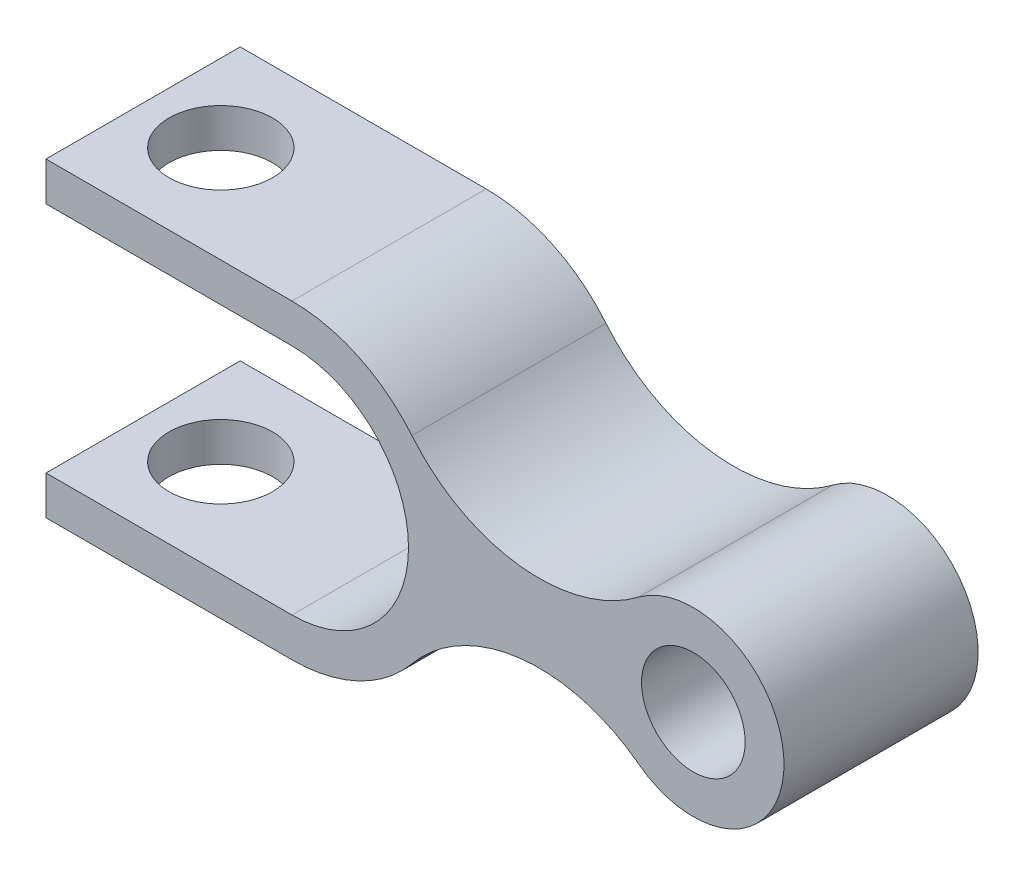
ISO-10303-21;
HEADER;
FILE_DESCRIPTION(('STEP AP214'),'2;1');
FILE_NAME('part.step','',(''),(''),'','','');
FILE_SCHEMA(('AUTOMOTIVE_DESIGN { 1 0 10303 214 1 1 1 1 }'));
ENDSEC;
DATA;
#1=APPLICATION_CONTEXT('core data for automotive mechanical design processes');
#2=APPLICATION_PROTOCOL_DEFINITION('international standard','automotive_design',2000,#1);
#3=PRODUCT_CONTEXT('',#1,'mechanical');
#4=PRODUCT('Part','Part','',(#3));
#5=PRODUCT_RELATED_PRODUCT_CATEGORY('part','',(#4));
#6=PRODUCT_DEFINITION_FORMATION('','',#4);
#7=PRODUCT_DEFINITION_CONTEXT('part definition',#1,'design');
#8=PRODUCT_DEFINITION('design','',#6,#7);
#9=PRODUCT_DEFINITION_SHAPE('','',#8);
#10=(LENGTH_UNIT() NAMED_UNIT(*) SI_UNIT(.MILLI.,.METRE.));
#11=(NAMED_UNIT(*) PLANE_ANGLE_UNIT() SI_UNIT($,.RADIAN.));
#12=(NAMED_UNIT(*) SI_UNIT($,.STERADIAN.) SOLID_ANGLE_UNIT());
#13=UNCERTAINTY_MEASURE_WITH_UNIT(LENGTH_MEASURE(1.E-05),#10,'distance_accuracy_value','');
#14=(GEOMETRIC_REPRESENTATION_CONTEXT(3) GLOBAL_UNCERTAINTY_ASSIGNED_CONTEXT((#13)) GLOBAL_UNIT_ASSIGNED_CONTEXT((#10,
#11,#12)) REPRESENTATION_CONTEXT('',''));
#15=CARTESIAN_POINT('',(0.,0.,0.));
#16=DIRECTION('',(0.,0.,1.));
#17=DIRECTION('',(1.,0.,0.));
#18=AXIS2_PLACEMENT_3D('',#15,#16,#17);
#19=CARTESIAN_POINT('',(96.0000000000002,0.,7.5));
#20=DIRECTION('',(0.,0.,1.));
#21=DIRECTION('',(1.,0.,0.));
#22=AXIS2_PLACEMENT_3D('',#19,#20,#21);
#23=PLANE('',#22);
#24=DIRECTION('',(0.,-1.,0.));
#25=VECTOR('',#24,1.);
#26=CARTESIAN_POINT('',(77.0000000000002,12.,7.5));
#27=LINE('',#26,#25);
#28=CARTESIAN_POINT('',(77.0000000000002,12.,7.5));
#29=VERTEX_POINT('',#28);
#30=CARTESIAN_POINT('',(77.0000000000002,9.,7.5));
#31=VERTEX_POINT('',#30);
#32=EDGE_CURVE('E168',#29,#31,#27,.T.);
#33=ORIENTED_EDGE('',*,*,#32,.T.);
#34=DIRECTION('',(1.,0.,0.));
#35=VECTOR('',#34,1.);
#36=CARTESIAN_POINT('',(77.0000000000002,9.,7.5));
#37=LINE('',#36,#35);
#38=CARTESIAN_POINT('',(96.0000000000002,9.,7.5));
#39=VERTEX_POINT('',#38);
#40=EDGE_CURVE('E137',#31,#39,#37,.T.);
#41=ORIENTED_EDGE('',*,*,#40,.T.);
#42=CARTESIAN_POINT('',(96.0000000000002,0.,7.5));
#43=DIRECTION('',(0.,0.,-1.));
#44=DIRECTION('',(1.,0.,0.));
#45=AXIS2_PLACEMENT_3D('',#42,#43,#44);
#46=CIRCLE('',#45,9.);
#47=CARTESIAN_POINT('',(96.0000000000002,-9.,7.5));
#48=VERTEX_POINT('',#47);
#49=EDGE_CURVE('E171',#39,#48,#46,.T.);
#50=ORIENTED_EDGE('',*,*,#49,.T.);
#51=DIRECTION('',(-1.,0.,0.));
#52=VECTOR('',#51,1.);
#53=CARTESIAN_POINT('',(77.0000000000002,-9.,7.5));
#54=LINE('',#53,#52);
#55=CARTESIAN_POINT('',(77.0000000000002,-9.,7.5));
#56=VERTEX_POINT('',#55);
#57=EDGE_CURVE('E173',#48,#56,#54,.T.);
#58=ORIENTED_EDGE('',*,*,#57,.T.);
#59=DIRECTION('',(0.,-1.,0.));
#60=VECTOR('',#59,1.);
#61=CARTESIAN_POINT('',(77.0000000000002,-12.,7.5));
#62=LINE('',#61,#60);
#63=CARTESIAN_POINT('',(77.0000000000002,-12.,7.5));
#64=VERTEX_POINT('',#63);
#65=EDGE_CURVE('E175',#56,#64,#62,.T.);
#66=ORIENTED_EDGE('',*,*,#65,.T.);
#67=DIRECTION('',(1.,0.,0.));
#68=VECTOR('',#67,1.);
#69=CARTESIAN_POINT('',(77.0000000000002,-12.,7.5));
#70=LINE('',#69,#68);
#71=CARTESIAN_POINT('',(96.0000000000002,-12.,7.5));
#72=VERTEX_POINT('',#71);
#73=EDGE_CURVE('E177',#64,#72,#70,.T.);
#74=ORIENTED_EDGE('',*,*,#73,.T.);
#75=CARTESIAN_POINT('',(96.0000000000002,0.,7.5));
#76=DIRECTION('',(0.,0.,1.));
#77=DIRECTION('',(-1.,0.,0.));
#78=AXIS2_PLACEMENT_3D('',#75,#76,#77);
#79=CIRCLE('',#78,12.);
#80=CARTESIAN_POINT('',(105.258158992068,-7.6345590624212,7.5));
#81=VERTEX_POINT('',#80);
#82=EDGE_CURVE('E179',#72,#81,#79,.T.);
#83=ORIENTED_EDGE('',*,*,#82,.T.);
#84=CARTESIAN_POINT('',(115.087059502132,-15.7397689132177,7.5));
#85=DIRECTION('',(0.,0.,-1.));
#86=DIRECTION('',(-1.,0.,0.));
#87=AXIS2_PLACEMENT_3D('',#84,#85,#86);
#88=CIRCLE('',#87,12.7397689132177);
#89=CARTESIAN_POINT('',(122.775503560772,-5.5815436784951,7.5));
#90=VERTEX_POINT('',#89);
#91=EDGE_CURVE('E181',#81,#90,#88,.T.);
#92=ORIENTED_EDGE('',*,*,#91,.T.);
#93=CARTESIAN_POINT('',(127.,0.,7.5));
#94=DIRECTION('',(0.,0.,1.));
#95=DIRECTION('',(1.,0.,0.));
#96=AXIS2_PLACEMENT_3D('',#93,#94,#95);
#97=CIRCLE('',#96,7.00000000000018);
#98=CARTESIAN_POINT('',(122.775503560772,5.58154367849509,7.5));
#99=VERTEX_POINT('',#98);
#100=EDGE_CURVE('E183',#90,#99,#97,.T.);
#101=ORIENTED_EDGE('',*,*,#100,.T.);
#102=CARTESIAN_POINT('',(115.087059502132,15.7397689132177,7.5));
#103=DIRECTION('',(0.,0.,-1.));
#104=DIRECTION('',(1.,0.,0.));
#105=AXIS2_PLACEMENT_3D('',#102,#103,#104);
#106=CIRCLE('',#105,12.7397689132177);
#107=CARTESIAN_POINT('',(105.258158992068,7.6345590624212,7.5));
#108=VERTEX_POINT('',#107);
#109=EDGE_CURVE('E185',#99,#108,#106,.T.);
#110=ORIENTED_EDGE('',*,*,#109,.T.);
#111=CARTESIAN_POINT('',(96.0000000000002,0.,7.5));
#112=DIRECTION('',(0.,0.,1.));
#113=DIRECTION('',(1.,0.,0.));
#114=AXIS2_PLACEMENT_3D('',#111,#112,#113);
#115=CIRCLE('',#114,12.);
#116=CARTESIAN_POINT('',(96.0000000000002,12.,7.5));
#117=VERTEX_POINT('',#116);
#118=EDGE_CURVE('E54',#108,#117,#115,.T.);
#119=ORIENTED_EDGE('',*,*,#118,.T.);
#120=DIRECTION('',(-1.,0.,0.));
#121=VECTOR('',#120,1.);
#122=CARTESIAN_POINT('',(77.0000000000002,12.,7.5));
#123=LINE('',#122,#121);
#124=EDGE_CURVE('E49',#117,#29,#123,.T.);
#125=ORIENTED_EDGE('',*,*,#124,.T.);
#126=EDGE_LOOP('',(#33,#41,#50,#58,#66,#74,#83,#92,#101,#110,#119,#125));
#127=FACE_BOUND('',#126,.T.);
#128=CARTESIAN_POINT('',(127.,0.,7.5));
#129=DIRECTION('',(0.,0.,1.));
#130=DIRECTION('',(1.,0.,0.));
#131=AXIS2_PLACEMENT_3D('',#128,#129,#130);
#132=CIRCLE('',#131,3.99999999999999);
#133=CARTESIAN_POINT('',(131.,0.,7.5));
#134=VERTEX_POINT('',#133);
#135=EDGE_CURVE('E142',#134,#134,#132,.T.);
#136=ORIENTED_EDGE('',*,*,#135,.F.);
#137=EDGE_LOOP('',(#136));
#138=FACE_BOUND('',#137,.T.);
#139=ADVANCED_FACE('F34',(#127,#138),#23,.T.);
#140=CARTESIAN_POINT('',(96.0000000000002,0.,-7.5));
#141=DIRECTION('',(0.,0.,1.));
#142=DIRECTION('',(1.,0.,0.));
#143=AXIS2_PLACEMENT_3D('',#140,#141,#142);
#144=PLANE('',#143);
#145=DIRECTION('',(0.,-1.,0.));
#146=VECTOR('',#145,1.);
#147=CARTESIAN_POINT('',(77.0000000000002,12.,-7.5));
#148=LINE('',#147,#146);
#149=CARTESIAN_POINT('',(77.0000000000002,12.,-7.5));
#150=VERTEX_POINT('',#149);
#151=CARTESIAN_POINT('',(77.0000000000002,9.,-7.5));
#152=VERTEX_POINT('',#151);
#153=EDGE_CURVE('E128',#150,#152,#148,.T.);
#154=ORIENTED_EDGE('',*,*,#153,.F.);
#155=DIRECTION('',(-1.,0.,0.));
#156=VECTOR('',#155,1.);
#157=CARTESIAN_POINT('',(77.0000000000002,12.,-7.5));
#158=LINE('',#157,#156);
#159=CARTESIAN_POINT('',(96.0000000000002,12.,-7.5));
#160=VERTEX_POINT('',#159);
#161=EDGE_CURVE('E166',#160,#150,#158,.T.);
#162=ORIENTED_EDGE('',*,*,#161,.F.);
#163=CARTESIAN_POINT('',(96.0000000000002,0.,-7.5));
#164=DIRECTION('',(0.,0.,1.));
#165=DIRECTION('',(1.,0.,0.));
#166=AXIS2_PLACEMENT_3D('',#163,#164,#165);
#167=CIRCLE('',#166,12.);
#168=CARTESIAN_POINT('',(105.258158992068,7.6345590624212,-7.5));
#169=VERTEX_POINT('',#168);
#170=EDGE_CURVE('E164',#169,#160,#167,.T.);
#171=ORIENTED_EDGE('',*,*,#170,.F.);
#172=CARTESIAN_POINT('',(115.087059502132,15.7397689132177,-7.5));
#173=DIRECTION('',(0.,0.,-1.));
#174=DIRECTION('',(1.,0.,0.));
#175=AXIS2_PLACEMENT_3D('',#172,#173,#174);
#176=CIRCLE('',#175,12.7397689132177);
#177=CARTESIAN_POINT('',(122.775503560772,5.58154367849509,-7.5));
#178=VERTEX_POINT('',#177);
#179=EDGE_CURVE('E162',#178,#169,#176,.T.);
#180=ORIENTED_EDGE('',*,*,#179,.F.);
#181=CARTESIAN_POINT('',(127.,0.,-7.5));
#182=DIRECTION('',(0.,0.,1.));
#183=DIRECTION('',(1.,0.,0.));
#184=AXIS2_PLACEMENT_3D('',#181,#182,#183);
#185=CIRCLE('',#184,7.00000000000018);
#186=CARTESIAN_POINT('',(122.775503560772,-5.5815436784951,-7.5));
#187=VERTEX_POINT('',#186);
#188=EDGE_CURVE('E160',#187,#178,#185,.T.);
#189=ORIENTED_EDGE('',*,*,#188,.F.);
#190=CARTESIAN_POINT('',(115.087059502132,-15.7397689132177,-7.5));
#191=DIRECTION('',(0.,0.,-1.));
#192=DIRECTION('',(-1.,0.,0.));
#193=AXIS2_PLACEMENT_3D('',#190,#191,#192);
#194=CIRCLE('',#193,12.7397689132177);
#195=CARTESIAN_POINT('',(105.258158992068,-7.6345590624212,-7.5));
#196=VERTEX_POINT('',#195);
#197=EDGE_CURVE('E158',#196,#187,#194,.T.);
#198=ORIENTED_EDGE('',*,*,#197,.F.);
#199=CARTESIAN_POINT('',(96.0000000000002,0.,-7.5));
#200=DIRECTION('',(0.,0.,1.));
#201=DIRECTION('',(-1.,0.,0.));
#202=AXIS2_PLACEMENT_3D('',#199,#200,#201);
#203=CIRCLE('',#202,12.);
#204=CARTESIAN_POINT('',(96.0000000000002,-12.,-7.5));
#205=VERTEX_POINT('',#204);
#206=EDGE_CURVE('E156',#205,#196,#203,.T.);
#207=ORIENTED_EDGE('',*,*,#206,.F.);
#208=DIRECTION('',(1.,0.,0.));
#209=VECTOR('',#208,1.);
#210=CARTESIAN_POINT('',(77.0000000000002,-12.,-7.5));
#211=LINE('',#210,#209);
#212=CARTESIAN_POINT('',(77.0000000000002,-12.,-7.5));
#213=VERTEX_POINT('',#212);
#214=EDGE_CURVE('E154',#213,#205,#211,.T.);
#215=ORIENTED_EDGE('',*,*,#214,.F.);
#216=DIRECTION('',(0.,-1.,0.));
#217=VECTOR('',#216,1.);
#218=CARTESIAN_POINT('',(77.0000000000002,-12.,-7.5));
#219=LINE('',#218,#217);
#220=CARTESIAN_POINT('',(77.0000000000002,-9.,-7.5));
#221=VERTEX_POINT('',#220);
#222=EDGE_CURVE('E152',#221,#213,#219,.T.);
#223=ORIENTED_EDGE('',*,*,#222,.F.);
#224=DIRECTION('',(-1.,0.,0.));
#225=VECTOR('',#224,1.);
#226=CARTESIAN_POINT('',(77.0000000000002,-9.,-7.5));
#227=LINE('',#226,#225);
#228=CARTESIAN_POINT('',(96.0000000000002,-9.,-7.5));
#229=VERTEX_POINT('',#228);
#230=EDGE_CURVE('E150',#229,#221,#227,.T.);
#231=ORIENTED_EDGE('',*,*,#230,.F.);
#232=CARTESIAN_POINT('',(96.0000000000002,0.,-7.5));
#233=DIRECTION('',(0.,0.,-1.));
#234=DIRECTION('',(1.,0.,0.));
#235=AXIS2_PLACEMENT_3D('',#232,#233,#234);
#236=CIRCLE('',#235,9.);
#237=CARTESIAN_POINT('',(96.0000000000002,9.,-7.5));
#238=VERTEX_POINT('',#237);
#239=EDGE_CURVE('E130',#238,#229,#236,.T.);
#240=ORIENTED_EDGE('',*,*,#239,.F.);
#241=DIRECTION('',(1.,0.,0.));
#242=VECTOR('',#241,1.);
#243=CARTESIAN_POINT('',(77.0000000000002,9.,-7.5));
#244=LINE('',#243,#242);
#245=EDGE_CURVE('E123',#152,#238,#244,.T.);
#246=ORIENTED_EDGE('',*,*,#245,.F.);
#247=EDGE_LOOP('',(#154,#162,#171,#180,#189,#198,#207,#215,#223,#231,#240,#246));
#248=FACE_BOUND('',#247,.T.);
#249=CARTESIAN_POINT('',(127.,0.,-7.5));
#250=DIRECTION('',(0.,0.,1.));
#251=DIRECTION('',(1.,0.,0.));
#252=AXIS2_PLACEMENT_3D('',#249,#250,#251);
#253=CIRCLE('',#252,3.99999999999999);
#254=CARTESIAN_POINT('',(131.,0.,-7.5));
#255=VERTEX_POINT('',#254);
#256=EDGE_CURVE('E145',#255,#255,#253,.T.);
#257=ORIENTED_EDGE('',*,*,#256,.T.);
#258=EDGE_LOOP('',(#257));
#259=FACE_BOUND('',#258,.T.);
#260=ADVANCED_FACE('F124',(#248,#259),#144,.F.);
#261=CARTESIAN_POINT('',(77.0000000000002,12.,7.5));
#262=DIRECTION('',(1.,0.,0.));
#263=DIRECTION('',(0.,0.,-1.));
#264=AXIS2_PLACEMENT_3D('',#261,#262,#263);
#265=PLANE('',#264);
#266=ORIENTED_EDGE('',*,*,#153,.T.);
#267=DIRECTION('',(0.,0.,-1.));
#268=VECTOR('',#267,1.);
#269=CARTESIAN_POINT('',(77.0000000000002,9.,7.5));
#270=LINE('',#269,#268);
#271=EDGE_CURVE('E11',#31,#152,#270,.T.);
#272=ORIENTED_EDGE('',*,*,#271,.F.);
#273=ORIENTED_EDGE('',*,*,#32,.F.);
#274=DIRECTION('',(0.,0.,-1.));
#275=VECTOR('',#274,1.);
#276=CARTESIAN_POINT('',(77.0000000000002,12.,7.5));
#277=LINE('',#276,#275);
#278=EDGE_CURVE('E141',#29,#150,#277,.T.);
#279=ORIENTED_EDGE('',*,*,#278,.T.);
#280=EDGE_LOOP('',(#266,#272,#273,#279));
#281=FACE_BOUND('',#280,.T.);
#282=ADVANCED_FACE('F36',(#281),#265,.F.);
#283=CARTESIAN_POINT('',(77.0000000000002,9.,7.5));
#284=DIRECTION('',(0.,1.,0.));
#285=DIRECTION('',(-1.,0.,0.));
#286=AXIS2_PLACEMENT_3D('',#283,#284,#285);
#287=PLANE('',#286);
#288=CARTESIAN_POINT('',(83.0000000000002,9.,0.));
#289=DIRECTION('',(0.,1.,0.));
#290=DIRECTION('',(-1.,0.,0.));
#291=AXIS2_PLACEMENT_3D('',#288,#289,#290);
#292=CIRCLE('',#291,4.00000000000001);
#293=CARTESIAN_POINT('',(79.0000000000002,9.,0.));
#294=VERTEX_POINT('',#293);
#295=EDGE_CURVE('E292',#294,#294,#292,.T.);
#296=ORIENTED_EDGE('',*,*,#295,.T.);
#297=EDGE_LOOP('',(#296));
#298=FACE_BOUND('',#297,.T.);
#299=ORIENTED_EDGE('',*,*,#245,.T.);
#300=DIRECTION('',(0.,0.,-1.));
#301=VECTOR('',#300,1.);
#302=CARTESIAN_POINT('',(96.0000000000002,9.,7.5));
#303=LINE('',#302,#301);
#304=EDGE_CURVE('E42',#39,#238,#303,.T.);
#305=ORIENTED_EDGE('',*,*,#304,.F.);
#306=ORIENTED_EDGE('',*,*,#40,.F.);
#307=ORIENTED_EDGE('',*,*,#271,.T.);
#308=EDGE_LOOP('',(#299,#305,#306,#307));
#309=FACE_BOUND('',#308,.T.);
#310=ADVANCED_FACE('F136',(#298,#309),#287,.F.);
#311=CARTESIAN_POINT('',(96.0000000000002,0.,7.5));
#312=DIRECTION('',(0.,0.,-1.));
#313=DIRECTION('',(-1.,0.,0.));
#314=AXIS2_PLACEMENT_3D('',#311,#312,#313);
#315=CYLINDRICAL_SURFACE('',#314,9.);
#316=ORIENTED_EDGE('',*,*,#239,.T.);
#317=DIRECTION('',(0.,0.,-1.));
#318=VECTOR('',#317,1.);
#319=CARTESIAN_POINT('',(96.0000000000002,-9.,7.5));
#320=LINE('',#319,#318);
#321=EDGE_CURVE('E214',#48,#229,#320,.T.);
#322=ORIENTED_EDGE('',*,*,#321,.F.);
#323=ORIENTED_EDGE('',*,*,#49,.F.);
#324=ORIENTED_EDGE('',*,*,#304,.T.);
#325=EDGE_LOOP('',(#316,#322,#323,#324));
#326=FACE_BOUND('',#325,.T.);
#327=ADVANCED_FACE('F218',(#326),#315,.F.);
#328=CARTESIAN_POINT('',(77.0000000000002,-9.,7.5));
#329=DIRECTION('',(0.,-1.,0.));
#330=DIRECTION('',(1.,0.,0.));
#331=AXIS2_PLACEMENT_3D('',#328,#329,#330);
#332=PLANE('',#331);
#333=CARTESIAN_POINT('',(83.0000000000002,-9.,0.));
#334=DIRECTION('',(0.,-1.,0.));
#335=DIRECTION('',(1.,0.,0.));
#336=AXIS2_PLACEMENT_3D('',#333,#334,#335);
#337=CIRCLE('',#336,4.00000000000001);
#338=CARTESIAN_POINT('',(87.0000000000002,-9.,0.));
#339=VERTEX_POINT('',#338);
#340=EDGE_CURVE('E294',#339,#339,#337,.T.);
#341=ORIENTED_EDGE('',*,*,#340,.T.);
#342=EDGE_LOOP('',(#341));
#343=FACE_BOUND('',#342,.T.);
#344=ORIENTED_EDGE('',*,*,#230,.T.);
#345=DIRECTION('',(0.,0.,-1.));
#346=VECTOR('',#345,1.);
#347=CARTESIAN_POINT('',(77.0000000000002,-9.,7.5));
#348=LINE('',#347,#346);
#349=EDGE_CURVE('E211',#56,#221,#348,.T.);
#350=ORIENTED_EDGE('',*,*,#349,.F.);
#351=ORIENTED_EDGE('',*,*,#57,.F.);
#352=ORIENTED_EDGE('',*,*,#321,.T.);
#353=EDGE_LOOP('',(#344,#350,#351,#352));
#354=FACE_BOUND('',#353,.T.);
#355=ADVANCED_FACE('F226',(#343,#354),#332,.F.);
#356=CARTESIAN_POINT('',(77.0000000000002,-12.,7.5));
#357=DIRECTION('',(1.,0.,0.));
#358=DIRECTION('',(0.,0.,-1.));
#359=AXIS2_PLACEMENT_3D('',#356,#357,#358);
#360=PLANE('',#359);
#361=ORIENTED_EDGE('',*,*,#222,.T.);
#362=DIRECTION('',(0.,0.,-1.));
#363=VECTOR('',#362,1.);
#364=CARTESIAN_POINT('',(77.0000000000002,-12.,7.5));
#365=LINE('',#364,#363);
#366=EDGE_CURVE('E208',#64,#213,#365,.T.);
#367=ORIENTED_EDGE('',*,*,#366,.F.);
#368=ORIENTED_EDGE('',*,*,#65,.F.);
#369=ORIENTED_EDGE('',*,*,#349,.T.);
#370=EDGE_LOOP('',(#361,#367,#368,#369));
#371=FACE_BOUND('',#370,.T.);
#372=ADVANCED_FACE('F229',(#371),#360,.F.);
#373=CARTESIAN_POINT('',(77.0000000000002,-12.,7.5));
#374=DIRECTION('',(0.,1.,0.));
#375=DIRECTION('',(-1.,0.,0.));
#376=AXIS2_PLACEMENT_3D('',#373,#374,#375);
#377=PLANE('',#376);
#378=CARTESIAN_POINT('',(83.0000000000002,-12.,0.));
#379=DIRECTION('',(0.,-1.,0.));
#380=DIRECTION('',(1.,0.,0.));
#381=AXIS2_PLACEMENT_3D('',#378,#379,#380);
#382=CIRCLE('',#381,4.00000000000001);
#383=CARTESIAN_POINT('',(87.0000000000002,-12.,0.));
#384=VERTEX_POINT('',#383);
#385=EDGE_CURVE('E301',#384,#384,#382,.T.);
#386=ORIENTED_EDGE('',*,*,#385,.F.);
#387=EDGE_LOOP('',(#386));
#388=FACE_BOUND('',#387,.T.);
#389=ORIENTED_EDGE('',*,*,#214,.T.);
#390=DIRECTION('',(0.,0.,-1.));
#391=VECTOR('',#390,1.);
#392=CARTESIAN_POINT('',(96.0000000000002,-12.,7.5));
#393=LINE('',#392,#391);
#394=EDGE_CURVE('E205',#72,#205,#393,.T.);
#395=ORIENTED_EDGE('',*,*,#394,.F.);
#396=ORIENTED_EDGE('',*,*,#73,.F.);
#397=ORIENTED_EDGE('',*,*,#366,.T.);
#398=EDGE_LOOP('',(#389,#395,#396,#397));
#399=FACE_BOUND('',#398,.T.);
#400=ADVANCED_FACE('F234',(#388,#399),#377,.F.);
#401=CARTESIAN_POINT('',(96.0000000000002,0.,7.5));
#402=DIRECTION('',(0.,0.,-1.));
#403=DIRECTION('',(-1.,0.,0.));
#404=AXIS2_PLACEMENT_3D('',#401,#402,#403);
#405=CYLINDRICAL_SURFACE('',#404,12.);
#406=ORIENTED_EDGE('',*,*,#206,.T.);
#407=DIRECTION('',(0.,0.,-1.));
#408=VECTOR('',#407,1.);
#409=CARTESIAN_POINT('',(105.258158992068,-7.6345590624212,7.5));
#410=LINE('',#409,#408);
#411=EDGE_CURVE('E202',#81,#196,#410,.T.);
#412=ORIENTED_EDGE('',*,*,#411,.F.);
#413=ORIENTED_EDGE('',*,*,#82,.F.);
#414=ORIENTED_EDGE('',*,*,#394,.T.);
#415=EDGE_LOOP('',(#406,#412,#413,#414));
#416=FACE_BOUND('',#415,.T.);
#417=ADVANCED_FACE('F240',(#416),#405,.T.);
#418=CARTESIAN_POINT('',(115.087059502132,-15.7397689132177,7.5));
#419=DIRECTION('',(0.,0.,-1.));
#420=DIRECTION('',(-1.,0.,0.));
#421=AXIS2_PLACEMENT_3D('',#418,#419,#420);
#422=CYLINDRICAL_SURFACE('',#421,12.7397689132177);
#423=ORIENTED_EDGE('',*,*,#197,.T.);
#424=DIRECTION('',(0.,0.,-1.));
#425=VECTOR('',#424,1.);
#426=CARTESIAN_POINT('',(122.775503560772,-5.5815436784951,7.5));
#427=LINE('',#426,#425);
#428=EDGE_CURVE('E199',#90,#187,#427,.T.);
#429=ORIENTED_EDGE('',*,*,#428,.F.);
#430=ORIENTED_EDGE('',*,*,#91,.F.);
#431=ORIENTED_EDGE('',*,*,#411,.T.);
#432=EDGE_LOOP('',(#423,#429,#430,#431));
#433=FACE_BOUND('',#432,.T.);
#434=ADVANCED_FACE('F244',(#433),#422,.F.);
#435=CARTESIAN_POINT('',(127.,0.,7.5));
#436=DIRECTION('',(0.,0.,-1.));
#437=DIRECTION('',(-1.,0.,0.));
#438=AXIS2_PLACEMENT_3D('',#435,#436,#437);
#439=CYLINDRICAL_SURFACE('',#438,7.00000000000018);
#440=ORIENTED_EDGE('',*,*,#188,.T.);
#441=DIRECTION('',(0.,0.,-1.));
#442=VECTOR('',#441,1.);
#443=CARTESIAN_POINT('',(122.775503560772,5.58154367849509,7.5));
#444=LINE('',#443,#442);
#445=EDGE_CURVE('E196',#99,#178,#444,.T.);
#446=ORIENTED_EDGE('',*,*,#445,.F.);
#447=ORIENTED_EDGE('',*,*,#100,.F.);
#448=ORIENTED_EDGE('',*,*,#428,.T.);
#449=EDGE_LOOP('',(#440,#446,#447,#448));
#450=FACE_BOUND('',#449,.T.);
#451=ADVANCED_FACE('F249',(#450),#439,.T.);
#452=CARTESIAN_POINT('',(115.087059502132,15.7397689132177,7.5));
#453=DIRECTION('',(0.,0.,-1.));
#454=DIRECTION('',(-1.,0.,0.));
#455=AXIS2_PLACEMENT_3D('',#452,#453,#454);
#456=CYLINDRICAL_SURFACE('',#455,12.7397689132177);
#457=ORIENTED_EDGE('',*,*,#179,.T.);
#458=DIRECTION('',(0.,0.,-1.));
#459=VECTOR('',#458,1.);
#460=CARTESIAN_POINT('',(105.258158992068,7.6345590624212,7.5));
#461=LINE('',#460,#459);
#462=EDGE_CURVE('E193',#108,#169,#461,.T.);
#463=ORIENTED_EDGE('',*,*,#462,.F.);
#464=ORIENTED_EDGE('',*,*,#109,.F.);
#465=ORIENTED_EDGE('',*,*,#445,.T.);
#466=EDGE_LOOP('',(#457,#463,#464,#465));
#467=FACE_BOUND('',#466,.T.);
#468=ADVANCED_FACE('F253',(#467),#456,.F.);
#469=CARTESIAN_POINT('',(96.0000000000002,0.,7.5));
#470=DIRECTION('',(0.,0.,-1.));
#471=DIRECTION('',(-1.,0.,0.));
#472=AXIS2_PLACEMENT_3D('',#469,#470,#471);
#473=CYLINDRICAL_SURFACE('',#472,12.);
#474=ORIENTED_EDGE('',*,*,#170,.T.);
#475=DIRECTION('',(0.,0.,-1.));
#476=VECTOR('',#475,1.);
#477=CARTESIAN_POINT('',(96.0000000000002,12.,7.5));
#478=LINE('',#477,#476);
#479=EDGE_CURVE('E190',#117,#160,#478,.T.);
#480=ORIENTED_EDGE('',*,*,#479,.F.);
#481=ORIENTED_EDGE('',*,*,#118,.F.);
#482=ORIENTED_EDGE('',*,*,#462,.T.);
#483=EDGE_LOOP('',(#474,#480,#481,#482));
#484=FACE_BOUND('',#483,.T.);
#485=ADVANCED_FACE('F257',(#484),#473,.T.);
#486=CARTESIAN_POINT('',(77.0000000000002,12.,7.5));
#487=DIRECTION('',(0.,-1.,0.));
#488=DIRECTION('',(1.,0.,0.));
#489=AXIS2_PLACEMENT_3D('',#486,#487,#488);
#490=PLANE('',#489);
#491=CARTESIAN_POINT('',(83.0000000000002,12.,0.));
#492=DIRECTION('',(0.,-1.,0.));
#493=DIRECTION('',(1.,0.,0.));
#494=AXIS2_PLACEMENT_3D('',#491,#492,#493);
#495=CIRCLE('',#494,4.00000000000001);
#496=CARTESIAN_POINT('',(87.0000000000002,12.,0.));
#497=VERTEX_POINT('',#496);
#498=EDGE_CURVE('E289',#497,#497,#495,.T.);
#499=ORIENTED_EDGE('',*,*,#498,.T.);
#500=EDGE_LOOP('',(#499));
#501=FACE_BOUND('',#500,.T.);
#502=ORIENTED_EDGE('',*,*,#161,.T.);
#503=ORIENTED_EDGE('',*,*,#278,.F.);
#504=ORIENTED_EDGE('',*,*,#124,.F.);
#505=ORIENTED_EDGE('',*,*,#479,.T.);
#506=EDGE_LOOP('',(#502,#503,#504,#505));
#507=FACE_BOUND('',#506,.T.);
#508=ADVANCED_FACE('F259',(#501,#507),#490,.F.);
#509=CARTESIAN_POINT('',(127.,0.,7.5));
#510=DIRECTION('',(0.,0.,-1.));
#511=DIRECTION('',(-1.,0.,0.));
#512=AXIS2_PLACEMENT_3D('',#509,#510,#511);
#513=CYLINDRICAL_SURFACE('',#512,3.99999999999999);
#514=ORIENTED_EDGE('',*,*,#135,.T.);
#515=EDGE_LOOP('',(#514));
#516=FACE_BOUND('',#515,.T.);
#517=ORIENTED_EDGE('',*,*,#256,.F.);
#518=EDGE_LOOP('',(#517));
#519=FACE_BOUND('',#518,.T.);
#520=ADVANCED_FACE('F261',(#516,#519),#513,.F.);
#521=CARTESIAN_POINT('',(83.0000000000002,12.,0.));
#522=DIRECTION('',(0.,-1.,0.));
#523=DIRECTION('',(1.,0.,0.));
#524=AXIS2_PLACEMENT_3D('',#521,#522,#523);
#525=CYLINDRICAL_SURFACE('',#524,4.00000000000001);
#526=ORIENTED_EDGE('',*,*,#498,.F.);
#527=EDGE_LOOP('',(#526));
#528=FACE_BOUND('',#527,.T.);
#529=ORIENTED_EDGE('',*,*,#295,.F.);
#530=EDGE_LOOP('',(#529));
#531=FACE_BOUND('',#530,.T.);
#532=ADVANCED_FACE('F268',(#528,#531),#525,.F.);
#533=ORIENTED_EDGE('',*,*,#385,.T.);
#534=EDGE_LOOP('',(#533));
#535=FACE_BOUND('',#534,.T.);
#536=ORIENTED_EDGE('',*,*,#340,.F.);
#537=EDGE_LOOP('',(#536));
#538=FACE_BOUND('',#537,.T.);
#539=ADVANCED_FACE('F281',(#535,#538),#525,.F.);
#540=CLOSED_SHELL('',(#139,#260,#282,#310,#327,#355,#372,#400,#417,#434,#451,#468,#485,#508,
#520,#532,#539));
#541=MANIFOLD_SOLID_BREP('B2',#540);
#542=ADVANCED_BREP_SHAPE_REPRESENTATION('',(#18,#541),#14);
#543=SHAPE_DEFINITION_REPRESENTATION(#9,#542);
ENDSEC;
END-ISO-10303-21;
